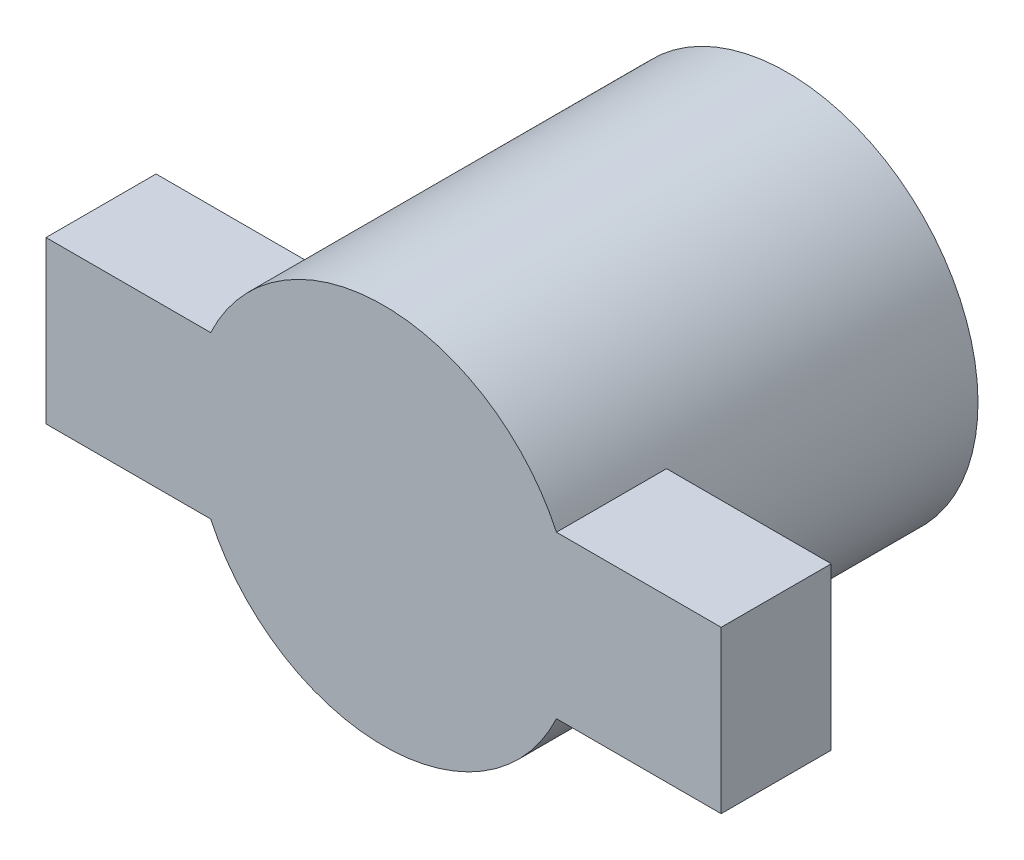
ISO-10303-21;
HEADER;
FILE_DESCRIPTION(('STEP AP214'),'2;1');
FILE_NAME('part.step','',(''),(''),'','','');
FILE_SCHEMA(('AUTOMOTIVE_DESIGN { 1 0 10303 214 1 1 1 1 }'));
ENDSEC;
DATA;
#1=APPLICATION_CONTEXT('core data for automotive mechanical design processes');
#2=APPLICATION_PROTOCOL_DEFINITION('international standard','automotive_design',2000,#1);
#3=PRODUCT_CONTEXT('',#1,'mechanical');
#4=PRODUCT('Part','Part','',(#3));
#5=PRODUCT_RELATED_PRODUCT_CATEGORY('part','',(#4));
#6=PRODUCT_DEFINITION_FORMATION('','',#4);
#7=PRODUCT_DEFINITION_CONTEXT('part definition',#1,'design');
#8=PRODUCT_DEFINITION('design','',#6,#7);
#9=PRODUCT_DEFINITION_SHAPE('','',#8);
#10=(LENGTH_UNIT() NAMED_UNIT(*) SI_UNIT(.MILLI.,.METRE.));
#11=(NAMED_UNIT(*) PLANE_ANGLE_UNIT() SI_UNIT($,.RADIAN.));
#12=(NAMED_UNIT(*) SI_UNIT($,.STERADIAN.) SOLID_ANGLE_UNIT());
#13=UNCERTAINTY_MEASURE_WITH_UNIT(LENGTH_MEASURE(1.E-05),#10,'distance_accuracy_value','');
#14=(GEOMETRIC_REPRESENTATION_CONTEXT(3) GLOBAL_UNCERTAINTY_ASSIGNED_CONTEXT((#13)) GLOBAL_UNIT_ASSIGNED_CONTEXT((#10,
#11,#12)) REPRESENTATION_CONTEXT('',''));
#15=CARTESIAN_POINT('',(0.,0.,0.));
#16=DIRECTION('',(0.,0.,1.));
#17=DIRECTION('',(1.,0.,0.));
#18=AXIS2_PLACEMENT_3D('',#15,#16,#17);
#19=CARTESIAN_POINT('',(0.,0.,-1.905));
#20=DIRECTION('',(0.,0.,-1.));
#21=DIRECTION('',(0.,-1.,0.));
#22=AXIS2_PLACEMENT_3D('',#19,#20,#21);
#23=PLANE('',#22);
#24=CARTESIAN_POINT('',(35.47,-6.26000000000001,-1.905));
#25=DIRECTION('',(0.,0.,-1.));
#26=DIRECTION('',(-1.,0.,0.));
#27=AXIS2_PLACEMENT_3D('',#24,#25,#26);
#28=CIRCLE('',#27,3.30200000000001);
#29=CARTESIAN_POINT('',(38.461921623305,-4.86300000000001,-1.905));
#30=VERTEX_POINT('',#29);
#31=CARTESIAN_POINT('',(38.461921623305,-7.65700000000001,-1.905));
#32=VERTEX_POINT('',#31);
#33=EDGE_CURVE('E11',#30,#32,#28,.T.);
#34=ORIENTED_EDGE('',*,*,#33,.F.);
#35=DIRECTION('',(-1.,0.,0.));
#36=VECTOR('',#35,1.);
#37=CARTESIAN_POINT('',(41.312,-4.86300000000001,-1.905));
#38=LINE('',#37,#36);
#39=CARTESIAN_POINT('',(41.312,-4.86300000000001,-1.905));
#40=VERTEX_POINT('',#39);
#41=EDGE_CURVE('E140',#40,#30,#38,.T.);
#42=ORIENTED_EDGE('',*,*,#41,.F.);
#43=DIRECTION('',(0.,1.,0.));
#44=VECTOR('',#43,1.);
#45=CARTESIAN_POINT('',(41.312,-7.65700000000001,-1.905));
#46=LINE('',#45,#44);
#47=CARTESIAN_POINT('',(41.312,-7.65700000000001,-1.905));
#48=VERTEX_POINT('',#47);
#49=EDGE_CURVE('E132',#48,#40,#46,.T.);
#50=ORIENTED_EDGE('',*,*,#49,.F.);
#51=DIRECTION('',(1.,0.,0.));
#52=VECTOR('',#51,1.);
#53=CARTESIAN_POINT('',(38.461921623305,-7.65700000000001,-1.905));
#54=LINE('',#53,#52);
#55=EDGE_CURVE('E141',#32,#48,#54,.T.);
#56=ORIENTED_EDGE('',*,*,#55,.F.);
#57=EDGE_LOOP('',(#34,#42,#50,#56));
#58=FACE_BOUND('',#57,.T.);
#59=ADVANCED_FACE('F33',(#58),#23,.T.);
#60=CARTESIAN_POINT('',(32.478078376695,-7.65700000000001,-1.905));
#61=VERTEX_POINT('',#60);
#62=CARTESIAN_POINT('',(32.478078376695,-4.86300000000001,-1.905));
#63=VERTEX_POINT('',#62);
#64=EDGE_CURVE('E43',#61,#63,#28,.T.);
#65=ORIENTED_EDGE('',*,*,#64,.F.);
#66=DIRECTION('',(1.,0.,0.));
#67=VECTOR('',#66,1.);
#68=CARTESIAN_POINT('',(29.628,-7.65700000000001,-1.905));
#69=LINE('',#68,#67);
#70=CARTESIAN_POINT('',(29.628,-7.65700000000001,-1.905));
#71=VERTEX_POINT('',#70);
#72=EDGE_CURVE('E82',#71,#61,#69,.T.);
#73=ORIENTED_EDGE('',*,*,#72,.F.);
#74=DIRECTION('',(0.,-1.,0.));
#75=VECTOR('',#74,1.);
#76=CARTESIAN_POINT('',(29.628,-4.86300000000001,-1.905));
#77=LINE('',#76,#75);
#78=CARTESIAN_POINT('',(29.628,-4.86300000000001,-1.905));
#79=VERTEX_POINT('',#78);
#80=EDGE_CURVE('E86',#79,#71,#77,.T.);
#81=ORIENTED_EDGE('',*,*,#80,.F.);
#82=DIRECTION('',(-1.,0.,0.));
#83=VECTOR('',#82,1.);
#84=CARTESIAN_POINT('',(32.478078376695,-4.86300000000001,-1.905));
#85=LINE('',#84,#83);
#86=EDGE_CURVE('E144',#63,#79,#85,.T.);
#87=ORIENTED_EDGE('',*,*,#86,.F.);
#88=EDGE_LOOP('',(#65,#73,#81,#87));
#89=FACE_BOUND('',#88,.T.);
#90=ADVANCED_FACE('F35',(#89),#23,.T.);
#91=CARTESIAN_POINT('',(35.47,-6.26000000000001,0.));
#92=DIRECTION('',(0.,0.,1.));
#93=DIRECTION('',(1.,0.,0.));
#94=AXIS2_PLACEMENT_3D('',#91,#92,#93);
#95=PLANE('',#94);
#96=CARTESIAN_POINT('',(35.47,-6.26000000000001,0.));
#97=DIRECTION('',(0.,0.,1.));
#98=DIRECTION('',(1.,0.,0.));
#99=AXIS2_PLACEMENT_3D('',#96,#97,#98);
#100=CIRCLE('',#99,3.302);
#101=CARTESIAN_POINT('',(38.461921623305,-4.86300000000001,0.));
#102=VERTEX_POINT('',#101);
#103=CARTESIAN_POINT('',(32.478078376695,-4.86300000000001,0.));
#104=VERTEX_POINT('',#103);
#105=EDGE_CURVE('E126',#102,#104,#100,.T.);
#106=ORIENTED_EDGE('',*,*,#105,.T.);
#107=DIRECTION('',(-1.,0.,0.));
#108=VECTOR('',#107,1.);
#109=CARTESIAN_POINT('',(32.478078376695,-4.86300000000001,0.));
#110=LINE('',#109,#108);
#111=CARTESIAN_POINT('',(29.628,-4.86300000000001,0.));
#112=VERTEX_POINT('',#111);
#113=EDGE_CURVE('E124',#104,#112,#110,.T.);
#114=ORIENTED_EDGE('',*,*,#113,.T.);
#115=DIRECTION('',(0.,-1.,0.));
#116=VECTOR('',#115,1.);
#117=CARTESIAN_POINT('',(29.628,-4.86300000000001,0.));
#118=LINE('',#117,#116);
#119=CARTESIAN_POINT('',(29.628,-7.65700000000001,0.));
#120=VERTEX_POINT('',#119);
#121=EDGE_CURVE('E109',#112,#120,#118,.T.);
#122=ORIENTED_EDGE('',*,*,#121,.T.);
#123=DIRECTION('',(1.,0.,0.));
#124=VECTOR('',#123,1.);
#125=CARTESIAN_POINT('',(29.628,-7.65700000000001,0.));
#126=LINE('',#125,#124);
#127=CARTESIAN_POINT('',(32.478078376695,-7.65700000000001,0.));
#128=VERTEX_POINT('',#127);
#129=EDGE_CURVE('E114',#120,#128,#126,.T.);
#130=ORIENTED_EDGE('',*,*,#129,.T.);
#131=CARTESIAN_POINT('',(35.47,-6.26000000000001,0.));
#132=DIRECTION('',(0.,0.,1.));
#133=DIRECTION('',(1.,0.,0.));
#134=AXIS2_PLACEMENT_3D('',#131,#132,#133);
#135=CIRCLE('',#134,3.302);
#136=CARTESIAN_POINT('',(38.461921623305,-7.65700000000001,0.));
#137=VERTEX_POINT('',#136);
#138=EDGE_CURVE('E120',#128,#137,#135,.T.);
#139=ORIENTED_EDGE('',*,*,#138,.T.);
#140=DIRECTION('',(1.,0.,0.));
#141=VECTOR('',#140,1.);
#142=CARTESIAN_POINT('',(38.461921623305,-7.65700000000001,0.));
#143=LINE('',#142,#141);
#144=CARTESIAN_POINT('',(41.312,-7.65700000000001,0.));
#145=VERTEX_POINT('',#144);
#146=EDGE_CURVE('E191',#137,#145,#143,.T.);
#147=ORIENTED_EDGE('',*,*,#146,.T.);
#148=DIRECTION('',(0.,1.,0.));
#149=VECTOR('',#148,1.);
#150=CARTESIAN_POINT('',(41.312,-7.65700000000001,0.));
#151=LINE('',#150,#149);
#152=CARTESIAN_POINT('',(41.312,-4.86300000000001,0.));
#153=VERTEX_POINT('',#152);
#154=EDGE_CURVE('E188',#145,#153,#151,.T.);
#155=ORIENTED_EDGE('',*,*,#154,.T.);
#156=DIRECTION('',(-1.,0.,0.));
#157=VECTOR('',#156,1.);
#158=CARTESIAN_POINT('',(41.312,-4.86300000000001,0.));
#159=LINE('',#158,#157);
#160=EDGE_CURVE('E185',#153,#102,#159,.T.);
#161=ORIENTED_EDGE('',*,*,#160,.T.);
#162=EDGE_LOOP('',(#106,#114,#122,#130,#139,#147,#155,#161));
#163=FACE_BOUND('',#162,.T.);
#164=ADVANCED_FACE('F123',(#163),#95,.T.);
#165=CARTESIAN_POINT('',(32.478078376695,-4.86300000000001,-15.3262023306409));
#166=DIRECTION('',(0.,1.,0.));
#167=DIRECTION('',(-1.,0.,0.));
#168=AXIS2_PLACEMENT_3D('',#165,#166,#167);
#169=PLANE('',#168);
#170=DIRECTION('',(0.,0.,1.));
#171=VECTOR('',#170,1.);
#172=CARTESIAN_POINT('',(32.478078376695,-4.86300000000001,-15.3262023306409));
#173=LINE('',#172,#171);
#174=EDGE_CURVE('E52',#63,#104,#173,.T.);
#175=ORIENTED_EDGE('',*,*,#174,.F.);
#176=ORIENTED_EDGE('',*,*,#86,.T.);
#177=DIRECTION('',(0.,0.,1.));
#178=VECTOR('',#177,1.);
#179=CARTESIAN_POINT('',(29.628,-4.86300000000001,-15.3262023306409));
#180=LINE('',#179,#178);
#181=EDGE_CURVE('E138',#79,#112,#180,.T.);
#182=ORIENTED_EDGE('',*,*,#181,.T.);
#183=ORIENTED_EDGE('',*,*,#113,.F.);
#184=EDGE_LOOP('',(#175,#176,#182,#183));
#185=FACE_BOUND('',#184,.T.);
#186=ADVANCED_FACE('F196',(#185),#169,.T.);
#187=CARTESIAN_POINT('',(29.628,-4.86300000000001,-15.3262023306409));
#188=DIRECTION('',(-1.,0.,0.));
#189=DIRECTION('',(0.,0.,1.));
#190=AXIS2_PLACEMENT_3D('',#187,#188,#189);
#191=PLANE('',#190);
#192=ORIENTED_EDGE('',*,*,#181,.F.);
#193=ORIENTED_EDGE('',*,*,#80,.T.);
#194=DIRECTION('',(0.,0.,1.));
#195=VECTOR('',#194,1.);
#196=CARTESIAN_POINT('',(29.628,-7.65700000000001,-15.3262023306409));
#197=LINE('',#196,#195);
#198=EDGE_CURVE('E105',#71,#120,#197,.T.);
#199=ORIENTED_EDGE('',*,*,#198,.T.);
#200=ORIENTED_EDGE('',*,*,#121,.F.);
#201=EDGE_LOOP('',(#192,#193,#199,#200));
#202=FACE_BOUND('',#201,.T.);
#203=ADVANCED_FACE('F107',(#202),#191,.T.);
#204=CARTESIAN_POINT('',(29.628,-7.65700000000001,-15.3262023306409));
#205=DIRECTION('',(0.,-1.,0.));
#206=DIRECTION('',(0.,0.,-1.));
#207=AXIS2_PLACEMENT_3D('',#204,#205,#206);
#208=PLANE('',#207);
#209=ORIENTED_EDGE('',*,*,#198,.F.);
#210=ORIENTED_EDGE('',*,*,#72,.T.);
#211=DIRECTION('',(0.,0.,1.));
#212=VECTOR('',#211,1.);
#213=CARTESIAN_POINT('',(32.478078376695,-7.65700000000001,-15.3262023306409));
#214=LINE('',#213,#212);
#215=EDGE_CURVE('E116',#61,#128,#214,.T.);
#216=ORIENTED_EDGE('',*,*,#215,.T.);
#217=ORIENTED_EDGE('',*,*,#129,.F.);
#218=EDGE_LOOP('',(#209,#210,#216,#217));
#219=FACE_BOUND('',#218,.T.);
#220=ADVANCED_FACE('F115',(#219),#208,.T.);
#221=CARTESIAN_POINT('',(35.47,-6.26000000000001,-15.3262023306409));
#222=DIRECTION('',(0.,0.,1.));
#223=DIRECTION('',(1.,0.,0.));
#224=AXIS2_PLACEMENT_3D('',#221,#222,#223);
#225=CYLINDRICAL_SURFACE('',#224,3.302);
#226=ORIENTED_EDGE('',*,*,#215,.F.);
#227=ORIENTED_EDGE('',*,*,#64,.T.);
#228=ORIENTED_EDGE('',*,*,#174,.T.);
#229=ORIENTED_EDGE('',*,*,#105,.F.);
#230=DIRECTION('',(0.,0.,1.));
#231=VECTOR('',#230,1.);
#232=CARTESIAN_POINT('',(38.461921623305,-4.86300000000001,-15.3262023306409));
#233=LINE('',#232,#231);
#234=EDGE_CURVE('E170',#30,#102,#233,.T.);
#235=ORIENTED_EDGE('',*,*,#234,.F.);
#236=ORIENTED_EDGE('',*,*,#33,.T.);
#237=DIRECTION('',(0.,0.,1.));
#238=VECTOR('',#237,1.);
#239=CARTESIAN_POINT('',(38.461921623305,-7.65700000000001,-15.3262023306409));
#240=LINE('',#239,#238);
#241=EDGE_CURVE('E157',#32,#137,#240,.T.);
#242=ORIENTED_EDGE('',*,*,#241,.T.);
#243=ORIENTED_EDGE('',*,*,#138,.F.);
#244=EDGE_LOOP('',(#226,#227,#228,#229,#235,#236,#242,#243));
#245=FACE_BOUND('',#244,.T.);
#246=CARTESIAN_POINT('',(35.47,-6.26000000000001,-6.985));
#247=DIRECTION('',(0.,0.,-1.));
#248=DIRECTION('',(-1.,0.,0.));
#249=AXIS2_PLACEMENT_3D('',#246,#247,#248);
#250=CIRCLE('',#249,3.30200000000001);
#251=CARTESIAN_POINT('',(32.168,-6.26000000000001,-6.985));
#252=VERTEX_POINT('',#251);
#253=EDGE_CURVE('E131',#252,#252,#250,.T.);
#254=ORIENTED_EDGE('',*,*,#253,.F.);
#255=EDGE_LOOP('',(#254));
#256=FACE_BOUND('',#255,.T.);
#257=ADVANCED_FACE('F181',(#245,#256),#225,.T.);
#258=CARTESIAN_POINT('',(38.461921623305,-7.65700000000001,-15.3262023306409));
#259=DIRECTION('',(0.,-1.,0.));
#260=DIRECTION('',(0.,0.,-1.));
#261=AXIS2_PLACEMENT_3D('',#258,#259,#260);
#262=PLANE('',#261);
#263=ORIENTED_EDGE('',*,*,#241,.F.);
#264=ORIENTED_EDGE('',*,*,#55,.T.);
#265=DIRECTION('',(0.,0.,1.));
#266=VECTOR('',#265,1.);
#267=CARTESIAN_POINT('',(41.312,-7.65700000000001,-15.3262023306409));
#268=LINE('',#267,#266);
#269=EDGE_CURVE('E136',#48,#145,#268,.T.);
#270=ORIENTED_EDGE('',*,*,#269,.T.);
#271=ORIENTED_EDGE('',*,*,#146,.F.);
#272=EDGE_LOOP('',(#263,#264,#270,#271));
#273=FACE_BOUND('',#272,.T.);
#274=ADVANCED_FACE('F245',(#273),#262,.T.);
#275=CARTESIAN_POINT('',(41.312,-7.65700000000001,-15.3262023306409));
#276=DIRECTION('',(1.,0.,0.));
#277=DIRECTION('',(0.,0.,-1.));
#278=AXIS2_PLACEMENT_3D('',#275,#276,#277);
#279=PLANE('',#278);
#280=ORIENTED_EDGE('',*,*,#269,.F.);
#281=ORIENTED_EDGE('',*,*,#49,.T.);
#282=DIRECTION('',(0.,0.,1.));
#283=VECTOR('',#282,1.);
#284=CARTESIAN_POINT('',(41.312,-4.86300000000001,-15.3262023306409));
#285=LINE('',#284,#283);
#286=EDGE_CURVE('E135',#40,#153,#285,.T.);
#287=ORIENTED_EDGE('',*,*,#286,.T.);
#288=ORIENTED_EDGE('',*,*,#154,.F.);
#289=EDGE_LOOP('',(#280,#281,#287,#288));
#290=FACE_BOUND('',#289,.T.);
#291=ADVANCED_FACE('F212',(#290),#279,.T.);
#292=CARTESIAN_POINT('',(41.312,-4.86300000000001,-15.3262023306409));
#293=DIRECTION('',(0.,1.,0.));
#294=DIRECTION('',(-1.,0.,0.));
#295=AXIS2_PLACEMENT_3D('',#292,#293,#294);
#296=PLANE('',#295);
#297=ORIENTED_EDGE('',*,*,#286,.F.);
#298=ORIENTED_EDGE('',*,*,#41,.T.);
#299=ORIENTED_EDGE('',*,*,#234,.T.);
#300=ORIENTED_EDGE('',*,*,#160,.F.);
#301=EDGE_LOOP('',(#297,#298,#299,#300));
#302=FACE_BOUND('',#301,.T.);
#303=ADVANCED_FACE('F176',(#302),#296,.T.);
#304=CARTESIAN_POINT('',(35.47,-6.26000000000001,-6.985));
#305=DIRECTION('',(0.,0.,-1.));
#306=DIRECTION('',(-1.,0.,0.));
#307=AXIS2_PLACEMENT_3D('',#304,#305,#306);
#308=PLANE('',#307);
#309=ORIENTED_EDGE('',*,*,#253,.T.);
#310=EDGE_LOOP('',(#309));
#311=FACE_BOUND('',#310,.T.);
#312=ADVANCED_FACE('F263',(#311),#308,.T.);
#313=CLOSED_SHELL('',(#59,#90,#164,#186,#203,#220,#257,#274,#291,#303,#312));
#314=MANIFOLD_SOLID_BREP('B2',#313);
#315=ADVANCED_BREP_SHAPE_REPRESENTATION('',(#18,#314),#14);
#316=SHAPE_DEFINITION_REPRESENTATION(#9,#315);
ENDSEC;
END-ISO-10303-21;
